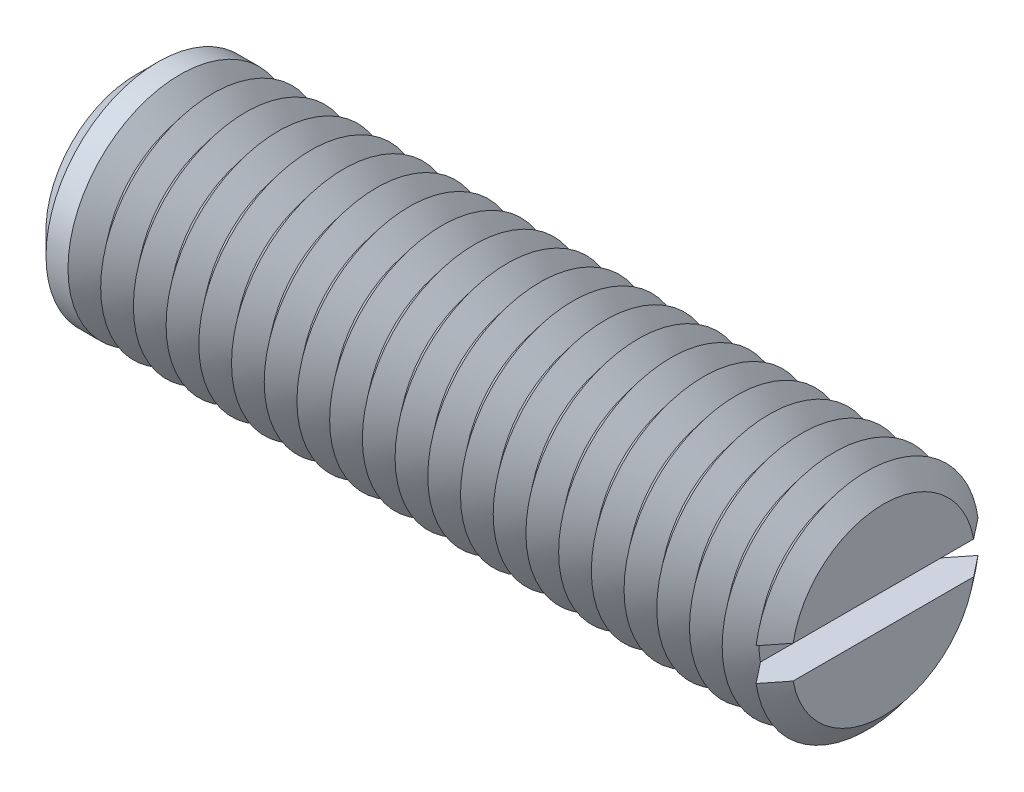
from build123d import *

# Parameters (mm, degrees)
SKETCH1_R       = 6
EXTRUDE1_DEPTH  = 20
SKETCH2_W       = 1.75
SKETCH2_H       = 1.75
EXTRUDE2_DEPTH  = 9
CHAMFER1_SIZE   = 1.2
LPATTERN1_COUNT = 22
LPATTERN1_PITCH = 1.75


with BuildPart() as part:
    # Sketch1 → Extrude1 (new, symmetric)
    with BuildSketch(Plane(origin=(0, 0, 0), x_dir=(0, 0, -1), z_dir=(1, 0, 0))):
        Circle(SKETCH1_R)
    extrude(amount=EXTRUDE1_DEPTH, both=True)

    # Sketch2 → Extrude2 (cut, symmetric)
    with BuildSketch(Plane.XY):
        with Locations((19.125, 0)):
            Rectangle(SKETCH2_W, SKETCH2_H)
    extrude(amount=EXTRUDE2_DEPTH, both=True, mode=Mode.SUBTRACT)

    # Chamfer1
    chamfer1_edges = [part.edges().sort_by_distance(p)[0] for p in [
        (-20, 0, 6),
    ]]
    chamfer(chamfer1_edges, length=CHAMFER1_SIZE)

    # Sketch3 → Cut-Revolve1 (revolve, cut)
    with BuildSketch(Plane.XY, mode=Mode.PRIVATE) as cut_revolve1_sk:
        Polygon((19.125, -6), (20.875, -6), (20, -4.90712535), align=None)
    cut_revolve1 = revolve(cut_revolve1_sk.sketch.rotate(Axis((0, 0, 0), (1, 0, 0)), 261.614461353), axis=Axis((0, 0, 0), (1, 0, 0)), mode=Mode.SUBTRACT)

    # LPattern1: Cut-Revolve1 ×22
    with Locations(*[(-i * LPATTERN1_PITCH, 0, 0) for i in range(1, LPATTERN1_COUNT)]):
        add(cut_revolve1, mode=Mode.SUBTRACT)


solid = part.part
